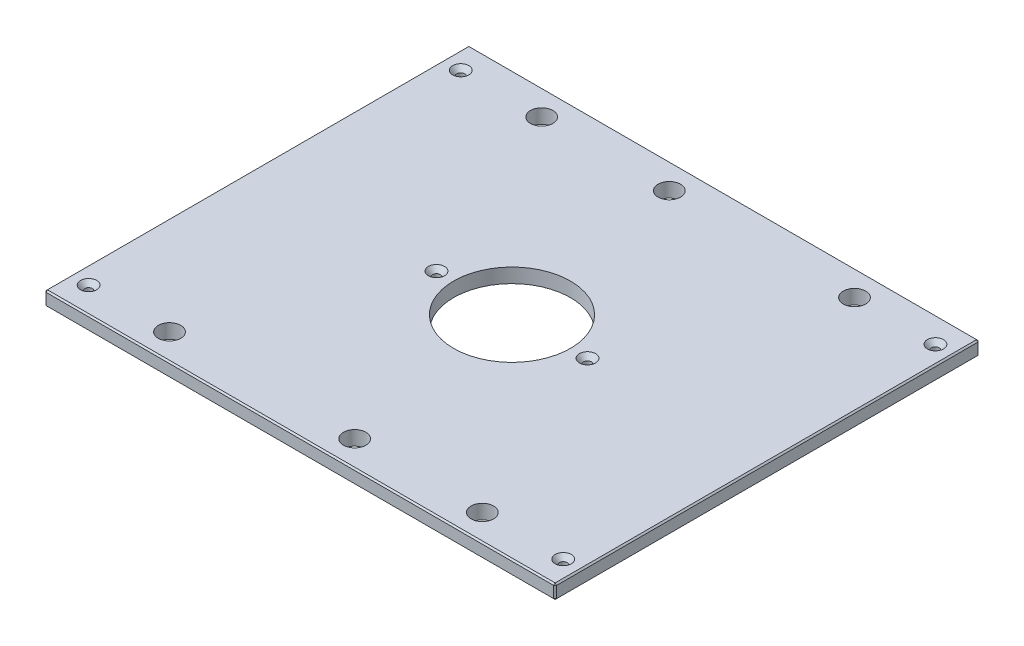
from build123d import *

# Parameters (mm, degrees)
SKETCH1_W                                        = 450.85
SKETCH1_H                                        = 374.65
BOSS_EXTRUDE1_DEPTH                              = 12.7
SKETCH13_R                                       = 51.562
CUT_EXTRUDE6_DEPTH                               = 294.374123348
F_25_32_0_78125_DIAMETER_HOLE1_D                 = 19.84375
CHAMFER2_SIZE                                    = 1.27
CSK_FOR_1_4_FLAT_HEAD_MACHINE_SCREW1_D           = 6.7564
CSK_FOR_1_4_FLAT_HEAD_MACHINE_SCREW1_CSINK_D     = 14.2748
CSK_FOR_1_4_FLAT_HEAD_MACHINE_SCREW1_CSINK_ANGLE = 82


with BuildPart() as part:
    # Sketch1 → Boss-Extrude1 (new body)
    with BuildSketch(Plane(origin=(0, 0, 0), x_dir=(1, 0, 0), z_dir=(0, 1, 0))):
        Rectangle(SKETCH1_W, SKETCH1_H)
    extrude(amount=BOSS_EXTRUDE1_DEPTH)

    # Sketch13 → Cut-Extrude6 (cut, through all)
    with BuildSketch(Plane(origin=(0, 12.7, 0), x_dir=(1, 0, 0), z_dir=(0, 1, 0))):
        with Locations(Location((0, 0, 0), (0, 0, 270))):
            Circle(SKETCH13_R)
    extrude(amount=-CUT_EXTRUDE6_DEPTH, mode=Mode.SUBTRACT)

    # 25_32 _0.78125_ Diameter Hole1 (through all)
    with Locations(Plane(origin=(0, 12.7, 0), x_dir=(1, 0, 0), z_dir=(0, 1, 0))):
        with Locations((138.1125, 164.30498), (-138.1125, 164.30498), (138.1125, -164.30498), (-138.1125, -164.30498), (-25.4, 164.30498), (25.4, -164.30498)):
            Hole(F_25_32_0_78125_DIAMETER_HOLE1_D / 2)

    # Chamfer2
    chamfer2_edges = [part.edges().sort_by_distance(p)[0] for p in [
        (225.425, 12.7, 0),
        (0, 12.7, -187.325),
        (-225.425, 12.7, 0),
        (0, 0, -187.325),
        (225.425, 0, 0),
        (0, 0, 187.325),
        (-225.425, 0, 0),
        (0, 12.7, 187.325),
        (-225.425, 6.35, -187.325),
        (225.425, 6.35, -187.325),
        (225.425, 6.35, 187.325),
        (-225.425, 6.35, 187.325),
    ]]
    chamfer(chamfer2_edges, length=CHAMFER2_SIZE)

    # CSK for 1_4 Flat Head Machine Screw1 (through all)
    with Locations(Plane(origin=(0, 12.7, 0), x_dir=(1, 0, 0), z_dir=(0, 1, 0))):
        with Locations((209.55, 164.30498), (209.55, -164.30498), (-209.55, -164.30498), (-66.675, 0), (66.675, 0), (-209.55, 164.30498), (-138.1125, 164.30498), (-138.1125, -164.30498)):
            CounterSinkHole(CSK_FOR_1_4_FLAT_HEAD_MACHINE_SCREW1_D / 2, CSK_FOR_1_4_FLAT_HEAD_MACHINE_SCREW1_CSINK_D / 2, counter_sink_angle=CSK_FOR_1_4_FLAT_HEAD_MACHINE_SCREW1_CSINK_ANGLE)


solid = part.part
